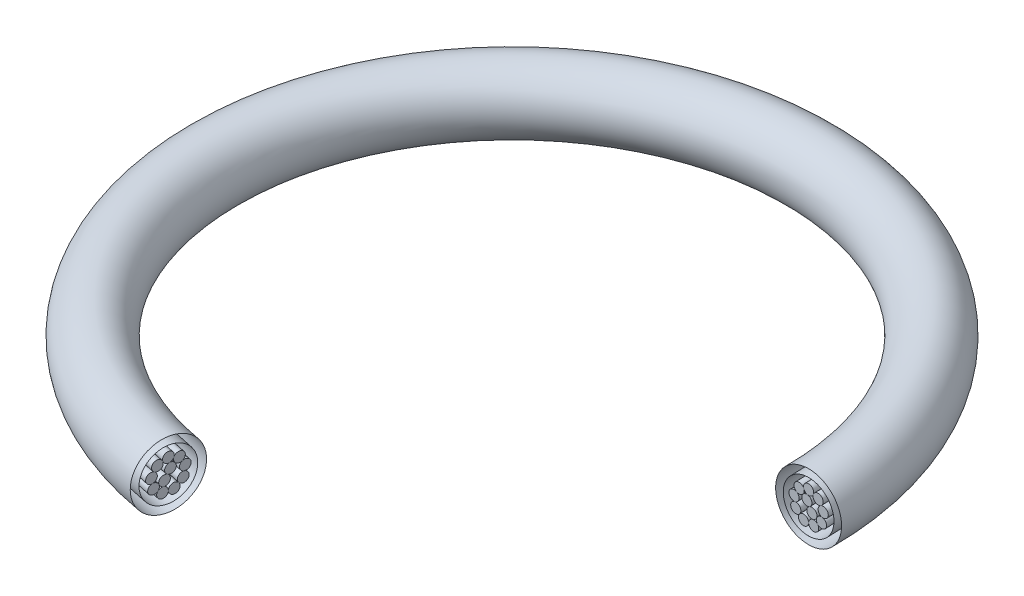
ISO-10303-21;
HEADER;
FILE_DESCRIPTION(('STEP AP214'),'2;1');
FILE_NAME('part.step','',(''),(''),'','','');
FILE_SCHEMA(('AUTOMOTIVE_DESIGN { 1 0 10303 214 1 1 1 1 }'));
ENDSEC;
DATA;
#1=APPLICATION_CONTEXT('core data for automotive mechanical design processes');
#2=APPLICATION_PROTOCOL_DEFINITION('international standard','automotive_design',2000,#1);
#3=PRODUCT_CONTEXT('',#1,'mechanical');
#4=PRODUCT('Part','Part','',(#3));
#5=PRODUCT_RELATED_PRODUCT_CATEGORY('part','',(#4));
#6=PRODUCT_DEFINITION_FORMATION('','',#4);
#7=PRODUCT_DEFINITION_CONTEXT('part definition',#1,'design');
#8=PRODUCT_DEFINITION('design','',#6,#7);
#9=PRODUCT_DEFINITION_SHAPE('','',#8);
#10=(LENGTH_UNIT() NAMED_UNIT(*) SI_UNIT(.MILLI.,.METRE.));
#11=(NAMED_UNIT(*) PLANE_ANGLE_UNIT() SI_UNIT($,.RADIAN.));
#12=(NAMED_UNIT(*) SI_UNIT($,.STERADIAN.) SOLID_ANGLE_UNIT());
#13=UNCERTAINTY_MEASURE_WITH_UNIT(LENGTH_MEASURE(1.E-05),#10,'distance_accuracy_value','');
#14=(GEOMETRIC_REPRESENTATION_CONTEXT(3) GLOBAL_UNCERTAINTY_ASSIGNED_CONTEXT((#13)) GLOBAL_UNIT_ASSIGNED_CONTEXT((#10,
#11,#12)) REPRESENTATION_CONTEXT('',''));
#15=CARTESIAN_POINT('',(0.,0.,0.));
#16=DIRECTION('',(0.,0.,1.));
#17=DIRECTION('',(1.,0.,0.));
#18=AXIS2_PLACEMENT_3D('',#15,#16,#17);
#19=CARTESIAN_POINT('',(0.,0.,0.));
#20=DIRECTION('',(0.,-1.,0.));
#21=DIRECTION('',(0.,0.,-1.));
#22=AXIS2_PLACEMENT_3D('',#19,#20,#21);
#23=TOROIDAL_SURFACE('',#22,185.7375,20.6376016);
#24=CARTESIAN_POINT('',(-32.2529783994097,0.,182.915730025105));
#25=DIRECTION('',(-0.98480775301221,0.,-0.173648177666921));
#26=DIRECTION('',(-0.173648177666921,0.,0.98480775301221));
#27=AXIS2_PLACEMENT_3D('',#24,#25,#26);
#28=CIRCLE('',#27,20.6376016);
#29=CARTESIAN_POINT('',(-35.8366603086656,0.,203.239800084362));
#30=VERTEX_POINT('',#29);
#31=EDGE_CURVE('E11',#30,#30,#28,.T.);
#32=CARTESIAN_POINT('',(185.7375,0.,0.));
#33=DIRECTION('',(0.,0.,1.));
#34=DIRECTION('',(1.,0.,0.));
#35=AXIS2_PLACEMENT_3D('',#32,#33,#34);
#36=CIRCLE('',#35,20.6376016);
#37=CARTESIAN_POINT('',(206.3751016,0.,0.));
#38=VERTEX_POINT('',#37);
#39=EDGE_CURVE('E50',#38,#38,#36,.T.);
#40=CARTESIAN_POINT('',(0.,0.,0.));
#41=DIRECTION('',(0.,-1.,0.));
#42=DIRECTION('',(0.,0.,-1.));
#43=AXIS2_PLACEMENT_3D('',#40,#41,#42);
#44=CIRCLE('',#43,206.3751016);
#45=EDGE_CURVE('',#30,#38,#44,.T.);
#46=ORIENTED_EDGE('',*,*,#31,.T.);
#47=ORIENTED_EDGE('',*,*,#39,.F.);
#48=ORIENTED_EDGE('',*,*,#45,.T.);
#49=ORIENTED_EDGE('',*,*,#45,.F.);
#50=EDGE_LOOP('',(#46,#48,#47,#49));
#51=FACE_BOUND('',#50,.T.);
#52=ADVANCED_FACE('F44',(#51),#23,.T.);
#53=CARTESIAN_POINT('',(-32.2529783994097,0.,182.915730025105));
#54=DIRECTION('',(-0.98480775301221,0.,-0.173648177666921));
#55=DIRECTION('',(-0.173648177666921,0.,0.98480775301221));
#56=AXIS2_PLACEMENT_3D('',#53,#54,#55);
#57=PLANE('',#56);
#58=CARTESIAN_POINT('',(-32.2529783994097,0.,182.915730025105));
#59=DIRECTION('',(-0.98480775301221,0.,-0.173648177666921));
#60=DIRECTION('',(-0.173648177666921,0.,0.98480775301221));
#61=AXIS2_PLACEMENT_3D('',#58,#59,#60);
#62=CIRCLE('',#61,20.6375);
#63=CARTESIAN_POINT('',(-35.8366426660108,0.,203.239700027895));
#64=VERTEX_POINT('',#63);
#65=EDGE_CURVE('E54',#64,#64,#62,.T.);
#66=ORIENTED_EDGE('',*,*,#65,.T.);
#67=EDGE_LOOP('',(#66));
#68=FACE_BOUND('',#67,.T.);
#69=ORIENTED_EDGE('',*,*,#31,.F.);
#70=EDGE_LOOP('',(#69));
#71=FACE_BOUND('',#70,.T.);
#72=ADVANCED_FACE('F68',(#68,#71),#57,.F.);
#73=CARTESIAN_POINT('',(185.7375,0.,0.));
#74=DIRECTION('',(0.,0.,1.));
#75=DIRECTION('',(1.,0.,0.));
#76=AXIS2_PLACEMENT_3D('',#73,#74,#75);
#77=PLANE('',#76);
#78=CARTESIAN_POINT('',(185.7375,0.,0.));
#79=DIRECTION('',(0.,0.,1.));
#80=DIRECTION('',(1.,0.,0.));
#81=AXIS2_PLACEMENT_3D('',#78,#79,#80);
#82=CIRCLE('',#81,20.6375);
#83=CARTESIAN_POINT('',(206.375,0.,0.));
#84=VERTEX_POINT('',#83);
#85=EDGE_CURVE('E58',#84,#84,#82,.T.);
#86=ORIENTED_EDGE('',*,*,#85,.F.);
#87=EDGE_LOOP('',(#86));
#88=FACE_BOUND('',#87,.T.);
#89=ORIENTED_EDGE('',*,*,#39,.T.);
#90=EDGE_LOOP('',(#89));
#91=FACE_BOUND('',#90,.T.);
#92=ADVANCED_FACE('F66',(#88,#91),#77,.T.);
#93=CARTESIAN_POINT('',(0.,0.,0.));
#94=DIRECTION('',(0.,-1.,0.));
#95=DIRECTION('',(0.,0.,-1.));
#96=AXIS2_PLACEMENT_3D('',#93,#94,#95);
#97=TOROIDAL_SURFACE('',#96,185.7375,20.6375);
#98=CARTESIAN_POINT('',(0.,0.,0.));
#99=DIRECTION('',(0.,-1.,0.));
#100=DIRECTION('',(0.,0.,-1.));
#101=AXIS2_PLACEMENT_3D('',#98,#99,#100);
#102=CIRCLE('',#101,206.375);
#103=EDGE_CURVE('',#64,#84,#102,.T.);
#104=ORIENTED_EDGE('',*,*,#65,.F.);
#105=ORIENTED_EDGE('',*,*,#85,.T.);
#106=ORIENTED_EDGE('',*,*,#103,.T.);
#107=ORIENTED_EDGE('',*,*,#103,.F.);
#108=EDGE_LOOP('',(#104,#106,#105,#107));
#109=FACE_BOUND('',#108,.T.);
#110=ADVANCED_FACE('F64',(#109),#97,.F.);
#111=CLOSED_SHELL('',(#52,#72,#92,#110));
#112=MANIFOLD_SOLID_BREP('B2',#111);
#113=CARTESIAN_POINT('',(0.,0.,0.));
#114=DIRECTION('',(0.,-1.,0.));
#115=DIRECTION('',(0.,0.,-1.));
#116=AXIS2_PLACEMENT_3D('',#113,#114,#115);
#117=TOROIDAL_SURFACE('',#116,185.7375,15.8751016);
#118=CARTESIAN_POINT('',(-32.2529783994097,0.,182.915730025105));
#119=DIRECTION('',(-0.98480775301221,0.,-0.173648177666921));
#120=DIRECTION('',(-0.173648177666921,0.,0.98480775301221));
#121=AXIS2_PLACEMENT_3D('',#118,#119,#120);
#122=CIRCLE('',#121,15.8751016);
#123=CARTESIAN_POINT('',(-35.0096608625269,0.,198.549653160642));
#124=VERTEX_POINT('',#123);
#125=EDGE_CURVE('E43',#124,#124,#122,.T.);
#126=CARTESIAN_POINT('',(185.7375,0.,0.));
#127=DIRECTION('',(0.,0.,1.));
#128=DIRECTION('',(1.,0.,0.));
#129=AXIS2_PLACEMENT_3D('',#126,#127,#128);
#130=CIRCLE('',#129,15.8751016);
#131=CARTESIAN_POINT('',(201.6126016,0.,0.));
#132=VERTEX_POINT('',#131);
#133=EDGE_CURVE('E120',#132,#132,#130,.T.);
#134=CARTESIAN_POINT('',(0.,0.,0.));
#135=DIRECTION('',(0.,-1.,0.));
#136=DIRECTION('',(0.,0.,-1.));
#137=AXIS2_PLACEMENT_3D('',#134,#135,#136);
#138=CIRCLE('',#137,201.6126016);
#139=EDGE_CURVE('',#124,#132,#138,.T.);
#140=ORIENTED_EDGE('',*,*,#125,.T.);
#141=ORIENTED_EDGE('',*,*,#133,.F.);
#142=ORIENTED_EDGE('',*,*,#139,.T.);
#143=ORIENTED_EDGE('',*,*,#139,.F.);
#144=EDGE_LOOP('',(#140,#142,#141,#143));
#145=FACE_BOUND('',#144,.T.);
#146=ADVANCED_FACE('F114',(#145),#117,.T.);
#147=CARTESIAN_POINT('',(-32.2529783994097,0.,182.915730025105));
#148=DIRECTION('',(-0.98480775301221,0.,-0.173648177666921));
#149=DIRECTION('',(-0.173648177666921,0.,0.98480775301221));
#150=AXIS2_PLACEMENT_3D('',#147,#148,#149);
#151=PLANE('',#150);
#152=CARTESIAN_POINT('',(-32.2529783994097,0.,182.915730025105));
#153=DIRECTION('',(-0.98480775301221,0.,-0.173648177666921));
#154=DIRECTION('',(-0.173648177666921,0.,0.98480775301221));
#155=AXIS2_PLACEMENT_3D('',#152,#153,#154);
#156=CIRCLE('',#155,15.875);
#157=CARTESIAN_POINT('',(-35.009643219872,0.,198.549553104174));
#158=VERTEX_POINT('',#157);
#159=EDGE_CURVE('E124',#158,#158,#156,.T.);
#160=ORIENTED_EDGE('',*,*,#159,.T.);
#161=EDGE_LOOP('',(#160));
#162=FACE_BOUND('',#161,.T.);
#163=ORIENTED_EDGE('',*,*,#125,.F.);
#164=EDGE_LOOP('',(#163));
#165=FACE_BOUND('',#164,.T.);
#166=ADVANCED_FACE('F138',(#162,#165),#151,.F.);
#167=CARTESIAN_POINT('',(185.7375,0.,0.));
#168=DIRECTION('',(0.,0.,1.));
#169=DIRECTION('',(1.,0.,0.));
#170=AXIS2_PLACEMENT_3D('',#167,#168,#169);
#171=PLANE('',#170);
#172=CARTESIAN_POINT('',(185.7375,0.,0.));
#173=DIRECTION('',(0.,0.,1.));
#174=DIRECTION('',(1.,0.,0.));
#175=AXIS2_PLACEMENT_3D('',#172,#173,#174);
#176=CIRCLE('',#175,15.875);
#177=CARTESIAN_POINT('',(201.6125,0.,0.));
#178=VERTEX_POINT('',#177);
#179=EDGE_CURVE('E128',#178,#178,#176,.T.);
#180=ORIENTED_EDGE('',*,*,#179,.F.);
#181=EDGE_LOOP('',(#180));
#182=FACE_BOUND('',#181,.T.);
#183=ORIENTED_EDGE('',*,*,#133,.T.);
#184=EDGE_LOOP('',(#183));
#185=FACE_BOUND('',#184,.T.);
#186=ADVANCED_FACE('F136',(#182,#185),#171,.T.);
#187=CARTESIAN_POINT('',(0.,0.,0.));
#188=DIRECTION('',(0.,-1.,0.));
#189=DIRECTION('',(0.,0.,-1.));
#190=AXIS2_PLACEMENT_3D('',#187,#188,#189);
#191=TOROIDAL_SURFACE('',#190,185.7375,15.875);
#192=CARTESIAN_POINT('',(0.,0.,0.));
#193=DIRECTION('',(0.,-1.,0.));
#194=DIRECTION('',(0.,0.,-1.));
#195=AXIS2_PLACEMENT_3D('',#192,#193,#194);
#196=CIRCLE('',#195,201.6125);
#197=EDGE_CURVE('',#158,#178,#196,.T.);
#198=ORIENTED_EDGE('',*,*,#159,.F.);
#199=ORIENTED_EDGE('',*,*,#179,.T.);
#200=ORIENTED_EDGE('',*,*,#197,.T.);
#201=ORIENTED_EDGE('',*,*,#197,.F.);
#202=EDGE_LOOP('',(#198,#200,#199,#201));
#203=FACE_BOUND('',#202,.T.);
#204=ADVANCED_FACE('F134',(#203),#191,.F.);
#205=CLOSED_SHELL('',(#146,#166,#186,#204));
#206=MANIFOLD_SOLID_BREP('B6',#205);
#207=CARTESIAN_POINT('',(0.,1.61198974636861,0.));
#208=DIRECTION('',(0.,-1.,0.));
#209=DIRECTION('',(0.,0.,-1.));
#210=AXIS2_PLACEMENT_3D('',#207,#208,#209);
#211=TOROIDAL_SURFACE('',#210,176.595451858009,3.175);
#212=CARTESIAN_POINT('',(-30.6654783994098,1.61198974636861,173.912570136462));
#213=DIRECTION('',(-0.98480775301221,0.,-0.173648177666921));
#214=DIRECTION('',(-0.173648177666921,0.,0.98480775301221));
#215=AXIS2_PLACEMENT_3D('',#212,#213,#214);
#216=CIRCLE('',#215,3.175);
#217=CARTESIAN_POINT('',(-31.2168113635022,1.61198974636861,177.039334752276));
#218=VERTEX_POINT('',#217);
#219=EDGE_CURVE('E191',#218,#218,#216,.T.);
#220=CARTESIAN_POINT('',(176.595451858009,1.61198974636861,0.));
#221=DIRECTION('',(0.,0.,1.));
#222=DIRECTION('',(1.,0.,0.));
#223=AXIS2_PLACEMENT_3D('',#220,#221,#222);
#224=CIRCLE('',#223,3.175);
#225=CARTESIAN_POINT('',(179.770451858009,1.61198974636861,0.));
#226=VERTEX_POINT('',#225);
#227=EDGE_CURVE('E113',#226,#226,#224,.T.);
#228=CARTESIAN_POINT('',(0.,1.61198974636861,0.));
#229=DIRECTION('',(0.,-1.,0.));
#230=DIRECTION('',(0.,0.,-1.));
#231=AXIS2_PLACEMENT_3D('',#228,#229,#230);
#232=CIRCLE('',#231,179.770451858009);
#233=EDGE_CURVE('',#218,#226,#232,.T.);
#234=ORIENTED_EDGE('',*,*,#219,.T.);
#235=ORIENTED_EDGE('',*,*,#227,.F.);
#236=ORIENTED_EDGE('',*,*,#233,.T.);
#237=ORIENTED_EDGE('',*,*,#233,.F.);
#238=EDGE_LOOP('',(#234,#236,#235,#237));
#239=FACE_BOUND('',#238,.T.);
#240=ADVANCED_FACE('F184',(#239),#211,.T.);
#241=CARTESIAN_POINT('',(0.,0.,0.));
#242=DIRECTION('',(-0.98480775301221,0.,-0.173648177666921));
#243=DIRECTION('',(-0.173648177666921,0.,0.98480775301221));
#244=AXIS2_PLACEMENT_3D('',#241,#242,#243);
#245=PLANE('',#244);
#246=ORIENTED_EDGE('',*,*,#219,.F.);
#247=EDGE_LOOP('',(#246));
#248=FACE_BOUND('',#247,.T.);
#249=ADVANCED_FACE('F198',(#248),#245,.F.);
#250=CARTESIAN_POINT('',(0.,0.,0.));
#251=DIRECTION('',(0.,0.,1.));
#252=DIRECTION('',(1.,0.,0.));
#253=AXIS2_PLACEMENT_3D('',#250,#251,#252);
#254=PLANE('',#253);
#255=ORIENTED_EDGE('',*,*,#227,.T.);
#256=EDGE_LOOP('',(#255));
#257=FACE_BOUND('',#256,.T.);
#258=ADVANCED_FACE('F186',(#257),#254,.T.);
#259=CLOSED_SHELL('',(#240,#249,#258));
#260=MANIFOLD_SOLID_BREP('B38',#259);
#261=CARTESIAN_POINT('',(0.,-4.64153948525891,0.));
#262=DIRECTION('',(0.,-1.,0.));
#263=DIRECTION('',(0.,0.,-1.));
#264=AXIS2_PLACEMENT_3D('',#261,#262,#263);
#265=TOROIDAL_SURFACE('',#264,177.698117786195,3.175);
#266=CARTESIAN_POINT('',(-30.8569543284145,-4.64153948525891,174.998484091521));
#267=DIRECTION('',(-0.98480775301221,0.,-0.173648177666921));
#268=DIRECTION('',(-0.173648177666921,0.,0.98480775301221));
#269=AXIS2_PLACEMENT_3D('',#266,#267,#268);
#270=CIRCLE('',#269,3.175);
#271=CARTESIAN_POINT('',(-31.408287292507,-4.64153948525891,178.125248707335));
#272=VERTEX_POINT('',#271);
#273=EDGE_CURVE('E240',#272,#272,#270,.T.);
#274=CARTESIAN_POINT('',(177.698117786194,-4.64153948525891,0.));
#275=DIRECTION('',(0.,0.,1.));
#276=DIRECTION('',(1.,0.,0.));
#277=AXIS2_PLACEMENT_3D('',#274,#275,#276);
#278=CIRCLE('',#277,3.175);
#279=CARTESIAN_POINT('',(180.873117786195,-4.64153948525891,0.));
#280=VERTEX_POINT('',#279);
#281=EDGE_CURVE('E183',#280,#280,#278,.T.);
#282=CARTESIAN_POINT('',(0.,-4.64153948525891,0.));
#283=DIRECTION('',(0.,-1.,0.));
#284=DIRECTION('',(0.,0.,-1.));
#285=AXIS2_PLACEMENT_3D('',#282,#283,#284);
#286=CIRCLE('',#285,180.873117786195);
#287=EDGE_CURVE('',#272,#280,#286,.T.);
#288=ORIENTED_EDGE('',*,*,#273,.T.);
#289=ORIENTED_EDGE('',*,*,#281,.F.);
#290=ORIENTED_EDGE('',*,*,#287,.T.);
#291=ORIENTED_EDGE('',*,*,#287,.F.);
#292=EDGE_LOOP('',(#288,#290,#289,#291));
#293=FACE_BOUND('',#292,.T.);
#294=ADVANCED_FACE('F233',(#293),#265,.T.);
#295=CARTESIAN_POINT('',(0.,0.,0.));
#296=DIRECTION('',(-0.98480775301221,0.,-0.173648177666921));
#297=DIRECTION('',(-0.173648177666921,0.,0.98480775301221));
#298=AXIS2_PLACEMENT_3D('',#295,#296,#297);
#299=PLANE('',#298);
#300=ORIENTED_EDGE('',*,*,#273,.F.);
#301=EDGE_LOOP('',(#300));
#302=FACE_BOUND('',#301,.T.);
#303=ADVANCED_FACE('F247',(#302),#299,.F.);
#304=CARTESIAN_POINT('',(0.,0.,0.));
#305=DIRECTION('',(0.,0.,1.));
#306=DIRECTION('',(1.,0.,0.));
#307=AXIS2_PLACEMENT_3D('',#304,#305,#306);
#308=PLANE('',#307);
#309=ORIENTED_EDGE('',*,*,#281,.T.);
#310=EDGE_LOOP('',(#309));
#311=FACE_BOUND('',#310,.T.);
#312=ADVANCED_FACE('F235',(#311),#308,.T.);
#313=CLOSED_SHELL('',(#294,#303,#312));
#314=MANIFOLD_SOLID_BREP('B108',#313);
#315=CARTESIAN_POINT('',(0.,7.1112510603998,0.));
#316=DIRECTION('',(0.,-1.,0.));
#317=DIRECTION('',(0.,0.,-1.));
#318=AXIS2_PLACEMENT_3D('',#315,#316,#317);
#319=TOROIDAL_SURFACE('',#318,179.770451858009,3.175);
#320=CARTESIAN_POINT('',(-31.2168113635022,7.1112510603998,177.039334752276));
#321=DIRECTION('',(-0.98480775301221,0.,-0.173648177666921));
#322=DIRECTION('',(-0.173648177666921,0.,0.98480775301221));
#323=AXIS2_PLACEMENT_3D('',#320,#321,#322);
#324=CIRCLE('',#323,3.175);
#325=CARTESIAN_POINT('',(-31.7681443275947,7.1112510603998,180.16609936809));
#326=VERTEX_POINT('',#325);
#327=EDGE_CURVE('E289',#326,#326,#324,.T.);
#328=CARTESIAN_POINT('',(179.770451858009,7.1112510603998,0.));
#329=DIRECTION('',(0.,0.,1.));
#330=DIRECTION('',(1.,0.,0.));
#331=AXIS2_PLACEMENT_3D('',#328,#329,#330);
#332=CIRCLE('',#331,3.175);
#333=CARTESIAN_POINT('',(182.94545185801,7.1112510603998,0.));
#334=VERTEX_POINT('',#333);
#335=EDGE_CURVE('E232',#334,#334,#332,.T.);
#336=CARTESIAN_POINT('',(0.,7.1112510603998,0.));
#337=DIRECTION('',(0.,-1.,0.));
#338=DIRECTION('',(0.,0.,-1.));
#339=AXIS2_PLACEMENT_3D('',#336,#337,#338);
#340=CIRCLE('',#339,182.94545185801);
#341=EDGE_CURVE('',#326,#334,#340,.T.);
#342=ORIENTED_EDGE('',*,*,#327,.T.);
#343=ORIENTED_EDGE('',*,*,#335,.F.);
#344=ORIENTED_EDGE('',*,*,#341,.T.);
#345=ORIENTED_EDGE('',*,*,#341,.F.);
#346=EDGE_LOOP('',(#342,#344,#343,#345));
#347=FACE_BOUND('',#346,.T.);
#348=ADVANCED_FACE('F282',(#347),#319,.T.);
#349=CARTESIAN_POINT('',(0.,0.,0.));
#350=DIRECTION('',(-0.98480775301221,0.,-0.173648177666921));
#351=DIRECTION('',(-0.173648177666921,0.,0.98480775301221));
#352=AXIS2_PLACEMENT_3D('',#349,#350,#351);
#353=PLANE('',#352);
#354=ORIENTED_EDGE('',*,*,#327,.F.);
#355=EDGE_LOOP('',(#354));
#356=FACE_BOUND('',#355,.T.);
#357=ADVANCED_FACE('F296',(#356),#353,.F.);
#358=CARTESIAN_POINT('',(0.,0.,0.));
#359=DIRECTION('',(0.,0.,1.));
#360=DIRECTION('',(1.,0.,0.));
#361=AXIS2_PLACEMENT_3D('',#358,#359,#360);
#362=PLANE('',#361);
#363=ORIENTED_EDGE('',*,*,#335,.T.);
#364=EDGE_LOOP('',(#363));
#365=FACE_BOUND('',#364,.T.);
#366=ADVANCED_FACE('F284',(#365),#362,.T.);
#367=CLOSED_SHELL('',(#348,#357,#366));
#368=MANIFOLD_SOLID_BREP('B178',#367);
#369=CARTESIAN_POINT('',(0.,-8.72324080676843,0.));
#370=DIRECTION('',(0.,-1.,0.));
#371=DIRECTION('',(0.,0.,-1.));
#372=AXIS2_PLACEMENT_3D('',#369,#370,#371);
#373=TOROIDAL_SURFACE('',#372,182.5625,3.175);
#374=CARTESIAN_POINT('',(-31.7016454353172,-8.72324080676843,179.788965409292));
#375=DIRECTION('',(-0.98480775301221,0.,-0.173648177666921));
#376=DIRECTION('',(-0.173648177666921,0.,0.98480775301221));
#377=AXIS2_PLACEMENT_3D('',#374,#375,#376);
#378=CIRCLE('',#377,3.175);
#379=CARTESIAN_POINT('',(-32.2529783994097,-8.72324080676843,182.915730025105));
#380=VERTEX_POINT('',#379);
#381=EDGE_CURVE('E338',#380,#380,#378,.T.);
#382=CARTESIAN_POINT('',(182.5625,-8.72324080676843,0.));
#383=DIRECTION('',(0.,0.,1.));
#384=DIRECTION('',(1.,0.,0.));
#385=AXIS2_PLACEMENT_3D('',#382,#383,#384);
#386=CIRCLE('',#385,3.175);
#387=CARTESIAN_POINT('',(185.7375,-8.72324080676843,0.));
#388=VERTEX_POINT('',#387);
#389=EDGE_CURVE('E281',#388,#388,#386,.T.);
#390=CARTESIAN_POINT('',(0.,-8.72324080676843,0.));
#391=DIRECTION('',(0.,-1.,0.));
#392=DIRECTION('',(0.,0.,-1.));
#393=AXIS2_PLACEMENT_3D('',#390,#391,#392);
#394=CIRCLE('',#393,185.7375);
#395=EDGE_CURVE('',#380,#388,#394,.T.);
#396=ORIENTED_EDGE('',*,*,#381,.T.);
#397=ORIENTED_EDGE('',*,*,#389,.F.);
#398=ORIENTED_EDGE('',*,*,#395,.T.);
#399=ORIENTED_EDGE('',*,*,#395,.F.);
#400=EDGE_LOOP('',(#396,#398,#397,#399));
#401=FACE_BOUND('',#400,.T.);
#402=ADVANCED_FACE('F331',(#401),#373,.T.);
#403=CARTESIAN_POINT('',(0.,0.,0.));
#404=DIRECTION('',(-0.98480775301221,0.,-0.173648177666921));
#405=DIRECTION('',(-0.173648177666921,0.,0.98480775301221));
#406=AXIS2_PLACEMENT_3D('',#403,#404,#405);
#407=PLANE('',#406);
#408=ORIENTED_EDGE('',*,*,#381,.F.);
#409=EDGE_LOOP('',(#408));
#410=FACE_BOUND('',#409,.T.);
#411=ADVANCED_FACE('F345',(#410),#407,.F.);
#412=CARTESIAN_POINT('',(0.,0.,0.));
#413=DIRECTION('',(0.,0.,1.));
#414=DIRECTION('',(1.,0.,0.));
#415=AXIS2_PLACEMENT_3D('',#412,#413,#414);
#416=PLANE('',#415);
#417=ORIENTED_EDGE('',*,*,#389,.T.);
#418=EDGE_LOOP('',(#417));
#419=FACE_BOUND('',#418,.T.);
#420=ADVANCED_FACE('F333',(#419),#416,.T.);
#421=CLOSED_SHELL('',(#402,#411,#420));
#422=MANIFOLD_SOLID_BREP('B227',#421);
#423=CARTESIAN_POINT('',(0.,9.2830789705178,0.));
#424=DIRECTION('',(0.,-1.,0.));
#425=DIRECTION('',(0.,0.,-1.));
#426=AXIS2_PLACEMENT_3D('',#423,#424,#425);
#427=TOROIDAL_SURFACE('',#426,185.7375,3.175);
#428=CARTESIAN_POINT('',(-32.2529783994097,9.2830789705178,182.915730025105));
#429=DIRECTION('',(-0.98480775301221,0.,-0.173648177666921));
#430=DIRECTION('',(-0.173648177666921,0.,0.98480775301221));
#431=AXIS2_PLACEMENT_3D('',#428,#429,#430);
#432=CIRCLE('',#431,3.175);
#433=CARTESIAN_POINT('',(-32.8043113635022,9.2830789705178,186.042494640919));
#434=VERTEX_POINT('',#433);
#435=EDGE_CURVE('E387',#434,#434,#432,.T.);
#436=CARTESIAN_POINT('',(185.7375,9.2830789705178,0.));
#437=DIRECTION('',(0.,0.,1.));
#438=DIRECTION('',(1.,0.,0.));
#439=AXIS2_PLACEMENT_3D('',#436,#437,#438);
#440=CIRCLE('',#439,3.175);
#441=CARTESIAN_POINT('',(188.9125,9.2830789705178,0.));
#442=VERTEX_POINT('',#441);
#443=EDGE_CURVE('E330',#442,#442,#440,.T.);
#444=CARTESIAN_POINT('',(0.,9.2830789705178,0.));
#445=DIRECTION('',(0.,-1.,0.));
#446=DIRECTION('',(0.,0.,-1.));
#447=AXIS2_PLACEMENT_3D('',#444,#445,#446);
#448=CIRCLE('',#447,188.9125);
#449=EDGE_CURVE('',#434,#442,#448,.T.);
#450=ORIENTED_EDGE('',*,*,#435,.T.);
#451=ORIENTED_EDGE('',*,*,#443,.F.);
#452=ORIENTED_EDGE('',*,*,#449,.T.);
#453=ORIENTED_EDGE('',*,*,#449,.F.);
#454=EDGE_LOOP('',(#450,#452,#451,#453));
#455=FACE_BOUND('',#454,.T.);
#456=ADVANCED_FACE('F380',(#455),#427,.T.);
#457=CARTESIAN_POINT('',(0.,0.,0.));
#458=DIRECTION('',(-0.98480775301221,0.,-0.173648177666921));
#459=DIRECTION('',(-0.173648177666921,0.,0.98480775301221));
#460=AXIS2_PLACEMENT_3D('',#457,#458,#459);
#461=PLANE('',#460);
#462=ORIENTED_EDGE('',*,*,#435,.F.);
#463=EDGE_LOOP('',(#462));
#464=FACE_BOUND('',#463,.T.);
#465=ADVANCED_FACE('F394',(#464),#461,.F.);
#466=CARTESIAN_POINT('',(0.,0.,0.));
#467=DIRECTION('',(0.,0.,1.));
#468=DIRECTION('',(1.,0.,0.));
#469=AXIS2_PLACEMENT_3D('',#466,#467,#468);
#470=PLANE('',#469);
#471=ORIENTED_EDGE('',*,*,#443,.T.);
#472=EDGE_LOOP('',(#471));
#473=FACE_BOUND('',#472,.T.);
#474=ADVANCED_FACE('F382',(#473),#470,.T.);
#475=CLOSED_SHELL('',(#456,#465,#474));
#476=MANIFOLD_SOLID_BREP('B276',#475);
#477=CARTESIAN_POINT('',(0.,3.02954973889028,0.));
#478=DIRECTION('',(0.,-1.,0.));
#479=DIRECTION('',(0.,0.,-1.));
#480=AXIS2_PLACEMENT_3D('',#477,#478,#479);
#481=TOROIDAL_SURFACE('',#480,184.634834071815,3.175);
#482=CARTESIAN_POINT('',(-32.061502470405,3.02954973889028,181.829816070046));
#483=DIRECTION('',(-0.98480775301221,0.,-0.173648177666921));
#484=DIRECTION('',(-0.173648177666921,0.,0.98480775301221));
#485=AXIS2_PLACEMENT_3D('',#482,#483,#484);
#486=CIRCLE('',#485,3.175);
#487=CARTESIAN_POINT('',(-32.6128354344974,3.02954973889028,184.95658068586));
#488=VERTEX_POINT('',#487);
#489=EDGE_CURVE('E436',#488,#488,#486,.T.);
#490=CARTESIAN_POINT('',(184.634834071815,3.02954973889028,0.));
#491=DIRECTION('',(0.,0.,1.));
#492=DIRECTION('',(1.,0.,0.));
#493=AXIS2_PLACEMENT_3D('',#490,#491,#492);
#494=CIRCLE('',#493,3.175);
#495=CARTESIAN_POINT('',(187.809834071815,3.02954973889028,0.));
#496=VERTEX_POINT('',#495);
#497=EDGE_CURVE('E379',#496,#496,#494,.T.);
#498=CARTESIAN_POINT('',(0.,3.02954973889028,0.));
#499=DIRECTION('',(0.,-1.,0.));
#500=DIRECTION('',(0.,0.,-1.));
#501=AXIS2_PLACEMENT_3D('',#498,#499,#500);
#502=CIRCLE('',#501,187.809834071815);
#503=EDGE_CURVE('',#488,#496,#502,.T.);
#504=ORIENTED_EDGE('',*,*,#489,.T.);
#505=ORIENTED_EDGE('',*,*,#497,.F.);
#506=ORIENTED_EDGE('',*,*,#503,.T.);
#507=ORIENTED_EDGE('',*,*,#503,.F.);
#508=EDGE_LOOP('',(#504,#506,#505,#507));
#509=FACE_BOUND('',#508,.T.);
#510=ADVANCED_FACE('F429',(#509),#481,.T.);
#511=CARTESIAN_POINT('',(0.,0.,0.));
#512=DIRECTION('',(0.,0.,1.));
#513=DIRECTION('',(1.,0.,0.));
#514=AXIS2_PLACEMENT_3D('',#511,#512,#513);
#515=PLANE('',#514);
#516=ORIENTED_EDGE('',*,*,#497,.T.);
#517=EDGE_LOOP('',(#516));
#518=FACE_BOUND('',#517,.T.);
#519=ADVANCED_FACE('F431',(#518),#515,.T.);
#520=CARTESIAN_POINT('',(0.,0.,0.));
#521=DIRECTION('',(-0.98480775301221,0.,-0.173648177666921));
#522=DIRECTION('',(-0.173648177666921,0.,0.98480775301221));
#523=AXIS2_PLACEMENT_3D('',#520,#521,#522);
#524=PLANE('',#523);
#525=ORIENTED_EDGE('',*,*,#489,.F.);
#526=EDGE_LOOP('',(#525));
#527=FACE_BOUND('',#526,.T.);
#528=ADVANCED_FACE('F443',(#527),#524,.F.);
#529=CLOSED_SHELL('',(#510,#519,#528));
#530=MANIFOLD_SOLID_BREP('B325',#529);
#531=CARTESIAN_POINT('',(0.,7.11125106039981,0.));
#532=DIRECTION('',(0.,-1.,0.));
#533=DIRECTION('',(0.,0.,-1.));
#534=AXIS2_PLACEMENT_3D('',#531,#532,#533);
#535=TOROIDAL_SURFACE('',#534,191.704548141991,3.175);
#536=CARTESIAN_POINT('',(-33.2891454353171,7.11125106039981,188.792125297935));
#537=DIRECTION('',(-0.98480775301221,0.,-0.173648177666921));
#538=DIRECTION('',(-0.173648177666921,0.,0.98480775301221));
#539=AXIS2_PLACEMENT_3D('',#536,#537,#538);
#540=CIRCLE('',#539,3.175);
#541=CARTESIAN_POINT('',(-33.8404783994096,7.11125106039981,191.918889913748));
#542=VERTEX_POINT('',#541);
#543=EDGE_CURVE('E494',#542,#542,#540,.T.);
#544=CARTESIAN_POINT('',(191.704548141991,7.11125106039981,0.));
#545=DIRECTION('',(0.,0.,1.));
#546=DIRECTION('',(1.,0.,0.));
#547=AXIS2_PLACEMENT_3D('',#544,#545,#546);
#548=CIRCLE('',#547,3.175);
#549=CARTESIAN_POINT('',(194.87954814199,7.11125106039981,0.));
#550=VERTEX_POINT('',#549);
#551=EDGE_CURVE('E428',#550,#550,#548,.T.);
#552=CARTESIAN_POINT('',(0.,7.11125106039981,0.));
#553=DIRECTION('',(0.,-1.,0.));
#554=DIRECTION('',(0.,0.,-1.));
#555=AXIS2_PLACEMENT_3D('',#552,#553,#554);
#556=CIRCLE('',#555,194.879548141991);
#557=EDGE_CURVE('',#542,#550,#556,.T.);
#558=ORIENTED_EDGE('',*,*,#543,.T.);
#559=ORIENTED_EDGE('',*,*,#551,.F.);
#560=ORIENTED_EDGE('',*,*,#557,.T.);
#561=ORIENTED_EDGE('',*,*,#557,.F.);
#562=EDGE_LOOP('',(#558,#560,#559,#561));
#563=FACE_BOUND('',#562,.T.);
#564=ADVANCED_FACE('F487',(#563),#535,.T.);
#565=CARTESIAN_POINT('',(0.,0.,0.));
#566=DIRECTION('',(-0.98480775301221,0.,-0.173648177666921));
#567=DIRECTION('',(-0.173648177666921,0.,0.98480775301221));
#568=AXIS2_PLACEMENT_3D('',#565,#566,#567);
#569=PLANE('',#568);
#570=ORIENTED_EDGE('',*,*,#543,.F.);
#571=EDGE_LOOP('',(#570));
#572=FACE_BOUND('',#571,.T.);
#573=ADVANCED_FACE('F501',(#572),#569,.F.);
#574=CARTESIAN_POINT('',(0.,0.,0.));
#575=DIRECTION('',(0.,0.,1.));
#576=DIRECTION('',(1.,0.,0.));
#577=AXIS2_PLACEMENT_3D('',#574,#575,#576);
#578=PLANE('',#577);
#579=ORIENTED_EDGE('',*,*,#551,.T.);
#580=EDGE_LOOP('',(#579));
#581=FACE_BOUND('',#580,.T.);
#582=ADVANCED_FACE('F489',(#581),#578,.T.);
#583=CLOSED_SHELL('',(#564,#573,#582));
#584=MANIFOLD_SOLID_BREP('B374',#583);
#585=CARTESIAN_POINT('',(0.,-8.72324080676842,0.));
#586=DIRECTION('',(0.,-1.,0.));
#587=DIRECTION('',(0.,0.,-1.));
#588=AXIS2_PLACEMENT_3D('',#585,#586,#587);
#589=TOROIDAL_SURFACE('',#588,188.9125,3.175);
#590=CARTESIAN_POINT('',(-32.8043113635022,-8.72324080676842,186.042494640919));
#591=DIRECTION('',(-0.98480775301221,0.,-0.173648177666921));
#592=DIRECTION('',(-0.173648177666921,0.,0.98480775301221));
#593=AXIS2_PLACEMENT_3D('',#590,#591,#592);
#594=CIRCLE('',#593,3.175);
#595=CARTESIAN_POINT('',(-33.3556443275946,-8.72324080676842,189.169259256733));
#596=VERTEX_POINT('',#595);
#597=EDGE_CURVE('E543',#596,#596,#594,.T.);
#598=CARTESIAN_POINT('',(188.9125,-8.72324080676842,0.));
#599=DIRECTION('',(0.,0.,1.));
#600=DIRECTION('',(1.,0.,0.));
#601=AXIS2_PLACEMENT_3D('',#598,#599,#600);
#602=CIRCLE('',#601,3.175);
#603=CARTESIAN_POINT('',(192.0875,-8.72324080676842,0.));
#604=VERTEX_POINT('',#603);
#605=EDGE_CURVE('E486',#604,#604,#602,.T.);
#606=CARTESIAN_POINT('',(0.,-8.72324080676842,0.));
#607=DIRECTION('',(0.,-1.,0.));
#608=DIRECTION('',(0.,0.,-1.));
#609=AXIS2_PLACEMENT_3D('',#606,#607,#608);
#610=CIRCLE('',#609,192.0875);
#611=EDGE_CURVE('',#596,#604,#610,.T.);
#612=ORIENTED_EDGE('',*,*,#597,.T.);
#613=ORIENTED_EDGE('',*,*,#605,.F.);
#614=ORIENTED_EDGE('',*,*,#611,.T.);
#615=ORIENTED_EDGE('',*,*,#611,.F.);
#616=EDGE_LOOP('',(#612,#614,#613,#615));
#617=FACE_BOUND('',#616,.T.);
#618=ADVANCED_FACE('F536',(#617),#589,.T.);
#619=CARTESIAN_POINT('',(0.,0.,0.));
#620=DIRECTION('',(-0.98480775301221,0.,-0.173648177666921));
#621=DIRECTION('',(-0.173648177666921,0.,0.98480775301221));
#622=AXIS2_PLACEMENT_3D('',#619,#620,#621);
#623=PLANE('',#622);
#624=ORIENTED_EDGE('',*,*,#597,.F.);
#625=EDGE_LOOP('',(#624));
#626=FACE_BOUND('',#625,.T.);
#627=ADVANCED_FACE('F550',(#626),#623,.F.);
#628=CARTESIAN_POINT('',(0.,0.,0.));
#629=DIRECTION('',(0.,0.,1.));
#630=DIRECTION('',(1.,0.,0.));
#631=AXIS2_PLACEMENT_3D('',#628,#629,#630);
#632=PLANE('',#631);
#633=ORIENTED_EDGE('',*,*,#605,.T.);
#634=EDGE_LOOP('',(#633));
#635=FACE_BOUND('',#634,.T.);
#636=ADVANCED_FACE('F538',(#635),#632,.T.);
#637=CLOSED_SHELL('',(#618,#627,#636));
#638=MANIFOLD_SOLID_BREP('B423',#637);
#639=CARTESIAN_POINT('',(0.,-2.46971157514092,0.));
#640=DIRECTION('',(0.,-1.,0.));
#641=DIRECTION('',(0.,0.,-1.));
#642=AXIS2_PLACEMENT_3D('',#639,#640,#641);
#643=TOROIDAL_SURFACE('',#642,187.809834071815,3.175);
#644=CARTESIAN_POINT('',(-32.6128354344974,-2.46971157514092,184.95658068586));
#645=DIRECTION('',(-0.98480775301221,0.,-0.173648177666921));
#646=DIRECTION('',(-0.173648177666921,0.,0.98480775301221));
#647=AXIS2_PLACEMENT_3D('',#644,#645,#646);
#648=CIRCLE('',#647,3.175);
#649=CARTESIAN_POINT('',(-33.1641683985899,-2.46971157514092,188.083345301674));
#650=VERTEX_POINT('',#649);
#651=EDGE_CURVE('E592',#650,#650,#648,.T.);
#652=CARTESIAN_POINT('',(187.809834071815,-2.46971157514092,0.));
#653=DIRECTION('',(0.,0.,1.));
#654=DIRECTION('',(1.,0.,0.));
#655=AXIS2_PLACEMENT_3D('',#652,#653,#654);
#656=CIRCLE('',#655,3.175);
#657=CARTESIAN_POINT('',(190.984834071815,-2.46971157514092,0.));
#658=VERTEX_POINT('',#657);
#659=EDGE_CURVE('E535',#658,#658,#656,.T.);
#660=CARTESIAN_POINT('',(0.,-2.46971157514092,0.));
#661=DIRECTION('',(0.,-1.,0.));
#662=DIRECTION('',(0.,0.,-1.));
#663=AXIS2_PLACEMENT_3D('',#660,#661,#662);
#664=CIRCLE('',#663,190.984834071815);
#665=EDGE_CURVE('',#650,#658,#664,.T.);
#666=ORIENTED_EDGE('',*,*,#651,.T.);
#667=ORIENTED_EDGE('',*,*,#659,.F.);
#668=ORIENTED_EDGE('',*,*,#665,.T.);
#669=ORIENTED_EDGE('',*,*,#665,.F.);
#670=EDGE_LOOP('',(#666,#668,#667,#669));
#671=FACE_BOUND('',#670,.T.);
#672=ADVANCED_FACE('F585',(#671),#643,.T.);
#673=CARTESIAN_POINT('',(0.,0.,0.));
#674=DIRECTION('',(-0.98480775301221,0.,-0.173648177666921));
#675=DIRECTION('',(-0.173648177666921,0.,0.98480775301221));
#676=AXIS2_PLACEMENT_3D('',#673,#674,#675);
#677=PLANE('',#676);
#678=ORIENTED_EDGE('',*,*,#651,.F.);
#679=EDGE_LOOP('',(#678));
#680=FACE_BOUND('',#679,.T.);
#681=ADVANCED_FACE('F599',(#680),#677,.F.);
#682=CARTESIAN_POINT('',(0.,0.,0.));
#683=DIRECTION('',(0.,0.,1.));
#684=DIRECTION('',(1.,0.,0.));
#685=AXIS2_PLACEMENT_3D('',#682,#683,#684);
#686=PLANE('',#685);
#687=ORIENTED_EDGE('',*,*,#659,.T.);
#688=EDGE_LOOP('',(#687));
#689=FACE_BOUND('',#688,.T.);
#690=ADVANCED_FACE('F587',(#689),#686,.T.);
#691=CLOSED_SHELL('',(#672,#681,#690));
#692=MANIFOLD_SOLID_BREP('B481',#691);
#693=CARTESIAN_POINT('',(0.,-4.64153948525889,0.));
#694=DIRECTION('',(0.,-1.,0.));
#695=DIRECTION('',(0.,0.,-1.));
#696=AXIS2_PLACEMENT_3D('',#693,#694,#695);
#697=TOROIDAL_SURFACE('',#696,193.776882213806,3.17499999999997);
#698=CARTESIAN_POINT('',(-33.6490024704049,-4.64153948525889,190.832975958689));
#699=DIRECTION('',(-0.98480775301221,0.,-0.173648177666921));
#700=DIRECTION('',(-0.173648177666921,0.,0.98480775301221));
#701=AXIS2_PLACEMENT_3D('',#698,#699,#700);
#702=CIRCLE('',#701,3.17499999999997);
#703=CARTESIAN_POINT('',(-34.2003354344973,-4.64153948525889,193.959740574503));
#704=VERTEX_POINT('',#703);
#705=EDGE_CURVE('E640',#704,#704,#702,.T.);
#706=CARTESIAN_POINT('',(193.776882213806,-4.64153948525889,0.));
#707=DIRECTION('',(0.,0.,1.));
#708=DIRECTION('',(1.,0.,0.));
#709=AXIS2_PLACEMENT_3D('',#706,#707,#708);
#710=CIRCLE('',#709,3.17499999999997);
#711=CARTESIAN_POINT('',(196.951882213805,-4.64153948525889,0.));
#712=VERTEX_POINT('',#711);
#713=EDGE_CURVE('E584',#712,#712,#710,.T.);
#714=CARTESIAN_POINT('',(0.,-4.64153948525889,0.));
#715=DIRECTION('',(0.,-1.,0.));
#716=DIRECTION('',(0.,0.,-1.));
#717=AXIS2_PLACEMENT_3D('',#714,#715,#716);
#718=CIRCLE('',#717,196.951882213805);
#719=EDGE_CURVE('',#704,#712,#718,.T.);
#720=ORIENTED_EDGE('',*,*,#705,.T.);
#721=ORIENTED_EDGE('',*,*,#713,.F.);
#722=ORIENTED_EDGE('',*,*,#719,.T.);
#723=ORIENTED_EDGE('',*,*,#719,.F.);
#724=EDGE_LOOP('',(#720,#722,#721,#723));
#725=FACE_BOUND('',#724,.T.);
#726=ADVANCED_FACE('F633',(#725),#697,.T.);
#727=CARTESIAN_POINT('',(0.,0.,0.));
#728=DIRECTION('',(-0.98480775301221,0.,-0.173648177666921));
#729=DIRECTION('',(-0.173648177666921,0.,0.98480775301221));
#730=AXIS2_PLACEMENT_3D('',#727,#728,#729);
#731=PLANE('',#730);
#732=ORIENTED_EDGE('',*,*,#705,.F.);
#733=EDGE_LOOP('',(#732));
#734=FACE_BOUND('',#733,.T.);
#735=ADVANCED_FACE('F647',(#734),#731,.F.);
#736=CARTESIAN_POINT('',(0.,0.,0.));
#737=DIRECTION('',(0.,0.,1.));
#738=DIRECTION('',(1.,0.,0.));
#739=AXIS2_PLACEMENT_3D('',#736,#737,#738);
#740=PLANE('',#739);
#741=ORIENTED_EDGE('',*,*,#713,.T.);
#742=EDGE_LOOP('',(#741));
#743=FACE_BOUND('',#742,.T.);
#744=ADVANCED_FACE('F635',(#743),#740,.T.);
#745=CLOSED_SHELL('',(#726,#735,#744));
#746=MANIFOLD_SOLID_BREP('B530',#745);
#747=CARTESIAN_POINT('',(0.,1.61198974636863,0.));
#748=DIRECTION('',(0.,-1.,0.));
#749=DIRECTION('',(0.,0.,-1.));
#750=AXIS2_PLACEMENT_3D('',#747,#748,#749);
#751=TOROIDAL_SURFACE('',#750,194.879548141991,3.175);
#752=CARTESIAN_POINT('',(-33.8404783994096,1.61198974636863,191.918889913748));
#753=DIRECTION('',(-0.98480775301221,0.,-0.173648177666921));
#754=DIRECTION('',(-0.173648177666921,0.,0.98480775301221));
#755=AXIS2_PLACEMENT_3D('',#752,#753,#754);
#756=CIRCLE('',#755,3.175);
#757=CARTESIAN_POINT('',(-34.3918113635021,1.61198974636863,195.045654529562));
#758=VERTEX_POINT('',#757);
#759=EDGE_CURVE('E632',#758,#758,#756,.T.);
#760=CARTESIAN_POINT('',(194.879548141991,1.61198974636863,0.));
#761=DIRECTION('',(0.,0.,1.));
#762=DIRECTION('',(1.,0.,0.));
#763=AXIS2_PLACEMENT_3D('',#760,#761,#762);
#764=CIRCLE('',#763,3.175);
#765=CARTESIAN_POINT('',(198.054548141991,1.61198974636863,0.));
#766=VERTEX_POINT('',#765);
#767=EDGE_CURVE('E680',#766,#766,#764,.T.);
#768=CARTESIAN_POINT('',(0.,1.61198974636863,0.));
#769=DIRECTION('',(0.,-1.,0.));
#770=DIRECTION('',(0.,0.,-1.));
#771=AXIS2_PLACEMENT_3D('',#768,#769,#770);
#772=CIRCLE('',#771,198.054548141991);
#773=EDGE_CURVE('',#758,#766,#772,.T.);
#774=ORIENTED_EDGE('',*,*,#759,.T.);
#775=ORIENTED_EDGE('',*,*,#767,.F.);
#776=ORIENTED_EDGE('',*,*,#773,.T.);
#777=ORIENTED_EDGE('',*,*,#773,.F.);
#778=EDGE_LOOP('',(#774,#776,#775,#777));
#779=FACE_BOUND('',#778,.T.);
#780=ADVANCED_FACE('F674',(#779),#751,.T.);
#781=CARTESIAN_POINT('',(0.,0.,0.));
#782=DIRECTION('',(-0.98480775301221,0.,-0.173648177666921));
#783=DIRECTION('',(-0.173648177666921,0.,0.98480775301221));
#784=AXIS2_PLACEMENT_3D('',#781,#782,#783);
#785=PLANE('',#784);
#786=ORIENTED_EDGE('',*,*,#759,.F.);
#787=EDGE_LOOP('',(#786));
#788=FACE_BOUND('',#787,.T.);
#789=ADVANCED_FACE('F689',(#788),#785,.F.);
#790=CARTESIAN_POINT('',(0.,0.,0.));
#791=DIRECTION('',(0.,0.,1.));
#792=DIRECTION('',(1.,0.,0.));
#793=AXIS2_PLACEMENT_3D('',#790,#791,#792);
#794=PLANE('',#793);
#795=ORIENTED_EDGE('',*,*,#767,.T.);
#796=EDGE_LOOP('',(#795));
#797=FACE_BOUND('',#796,.T.);
#798=ADVANCED_FACE('F686',(#797),#794,.T.);
#799=CLOSED_SHELL('',(#780,#789,#798));
#800=MANIFOLD_SOLID_BREP('B579',#799);
#801=ADVANCED_BREP_SHAPE_REPRESENTATION('',(#18,#112,#206,#260,#314,#368,#422,#476,#530,#584,
#638,#692,#746,#800),#14);
#802=SHAPE_DEFINITION_REPRESENTATION(#9,#801);
ENDSEC;
END-ISO-10303-21;
